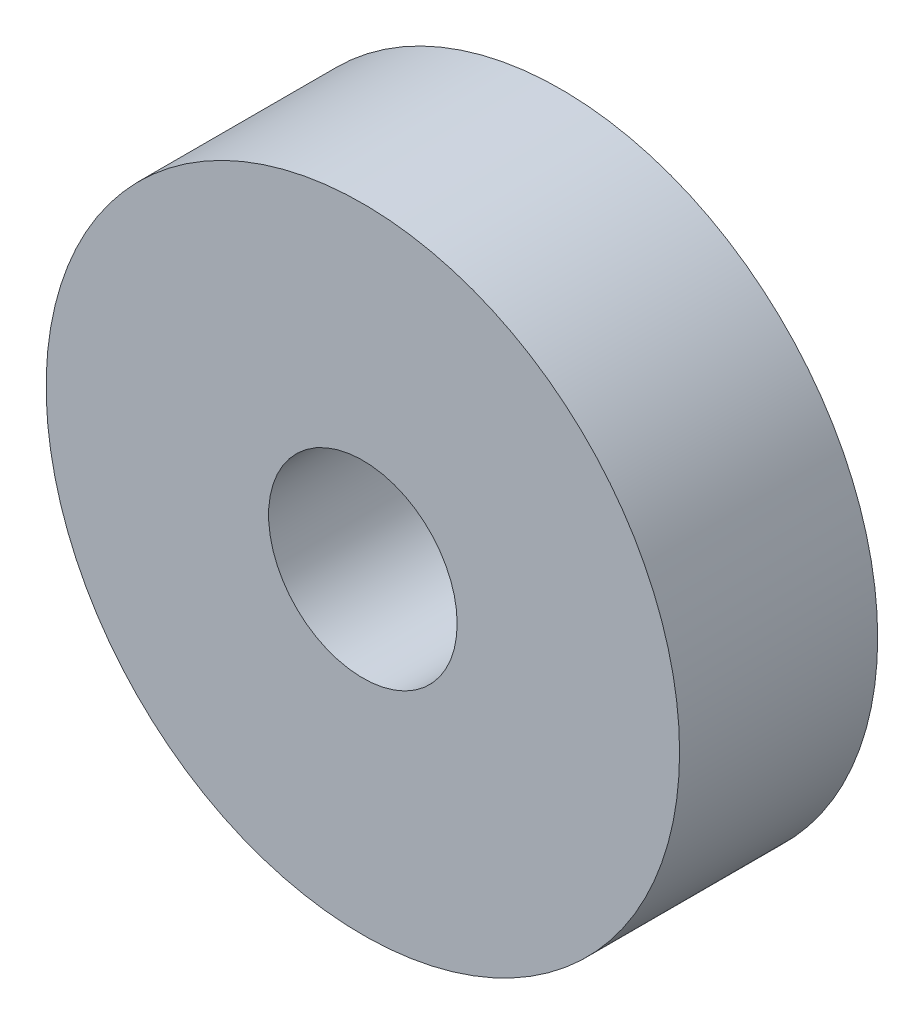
ISO-10303-21;
HEADER;
FILE_DESCRIPTION(('STEP AP214'),'2;1');
FILE_NAME('part.step','',(''),(''),'','','');
FILE_SCHEMA(('AUTOMOTIVE_DESIGN { 1 0 10303 214 1 1 1 1 }'));
ENDSEC;
DATA;
#1=APPLICATION_CONTEXT('core data for automotive mechanical design processes');
#2=APPLICATION_PROTOCOL_DEFINITION('international standard','automotive_design',2000,#1);
#3=PRODUCT_CONTEXT('',#1,'mechanical');
#4=PRODUCT('Part','Part','',(#3));
#5=PRODUCT_RELATED_PRODUCT_CATEGORY('part','',(#4));
#6=PRODUCT_DEFINITION_FORMATION('','',#4);
#7=PRODUCT_DEFINITION_CONTEXT('part definition',#1,'design');
#8=PRODUCT_DEFINITION('design','',#6,#7);
#9=PRODUCT_DEFINITION_SHAPE('','',#8);
#10=(LENGTH_UNIT() NAMED_UNIT(*) SI_UNIT(.MILLI.,.METRE.));
#11=(NAMED_UNIT(*) PLANE_ANGLE_UNIT() SI_UNIT($,.RADIAN.));
#12=(NAMED_UNIT(*) SI_UNIT($,.STERADIAN.) SOLID_ANGLE_UNIT());
#13=UNCERTAINTY_MEASURE_WITH_UNIT(LENGTH_MEASURE(1.E-05),#10,'distance_accuracy_value','');
#14=(GEOMETRIC_REPRESENTATION_CONTEXT(3) GLOBAL_UNCERTAINTY_ASSIGNED_CONTEXT((#13)) GLOBAL_UNIT_ASSIGNED_CONTEXT((#10,
#11,#12)) REPRESENTATION_CONTEXT('',''));
#15=CARTESIAN_POINT('',(0.,0.,0.));
#16=DIRECTION('',(0.,0.,1.));
#17=DIRECTION('',(1.,0.,0.));
#18=AXIS2_PLACEMENT_3D('',#15,#16,#17);
#19=CARTESIAN_POINT('',(0.,0.,3.175));
#20=DIRECTION('',(0.,0.,1.));
#21=DIRECTION('',(1.,0.,0.));
#22=AXIS2_PLACEMENT_3D('',#19,#20,#21);
#23=PLANE('',#22);
#24=CARTESIAN_POINT('',(0.,0.,3.175));
#25=DIRECTION('',(0.,0.,1.));
#26=DIRECTION('',(1.,0.,0.));
#27=AXIS2_PLACEMENT_3D('',#24,#25,#26);
#28=CIRCLE('',#27,5.0762);
#29=CARTESIAN_POINT('',(5.0762,0.,3.175));
#30=VERTEX_POINT('',#29);
#31=EDGE_CURVE('E12',#30,#30,#28,.T.);
#32=ORIENTED_EDGE('',*,*,#31,.T.);
#33=EDGE_LOOP('',(#32));
#34=FACE_BOUND('',#33,.T.);
#35=CARTESIAN_POINT('',(0.,0.,3.175));
#36=DIRECTION('',(0.,0.,1.));
#37=DIRECTION('',(1.,0.,0.));
#38=AXIS2_PLACEMENT_3D('',#35,#36,#37);
#39=CIRCLE('',#38,1.5113);
#40=CARTESIAN_POINT('',(1.5113,0.,3.175));
#41=VERTEX_POINT('',#40);
#42=EDGE_CURVE('E47',#41,#41,#39,.T.);
#43=ORIENTED_EDGE('',*,*,#42,.F.);
#44=EDGE_LOOP('',(#43));
#45=FACE_BOUND('',#44,.T.);
#46=ADVANCED_FACE('F36',(#34,#45),#23,.T.);
#47=CARTESIAN_POINT('',(0.,0.,0.));
#48=DIRECTION('',(0.,0.,1.));
#49=DIRECTION('',(1.,0.,0.));
#50=AXIS2_PLACEMENT_3D('',#47,#48,#49);
#51=PLANE('',#50);
#52=CARTESIAN_POINT('',(0.,0.,0.));
#53=DIRECTION('',(0.,0.,1.));
#54=DIRECTION('',(1.,0.,0.));
#55=AXIS2_PLACEMENT_3D('',#52,#53,#54);
#56=CIRCLE('',#55,5.0762);
#57=CARTESIAN_POINT('',(5.0762,0.,0.));
#58=VERTEX_POINT('',#57);
#59=EDGE_CURVE('E40',#58,#58,#56,.T.);
#60=ORIENTED_EDGE('',*,*,#59,.F.);
#61=EDGE_LOOP('',(#60));
#62=FACE_BOUND('',#61,.T.);
#63=CARTESIAN_POINT('',(0.,0.,0.));
#64=DIRECTION('',(0.,0.,1.));
#65=DIRECTION('',(1.,0.,0.));
#66=AXIS2_PLACEMENT_3D('',#63,#64,#65);
#67=CIRCLE('',#66,1.5113);
#68=CARTESIAN_POINT('',(1.5113,0.,0.));
#69=VERTEX_POINT('',#68);
#70=EDGE_CURVE('E50',#69,#69,#67,.T.);
#71=ORIENTED_EDGE('',*,*,#70,.T.);
#72=EDGE_LOOP('',(#71));
#73=FACE_BOUND('',#72,.T.);
#74=ADVANCED_FACE('F60',(#62,#73),#51,.F.);
#75=CARTESIAN_POINT('',(0.,0.,3.175));
#76=DIRECTION('',(0.,0.,-1.));
#77=DIRECTION('',(-1.,0.,0.));
#78=AXIS2_PLACEMENT_3D('',#75,#76,#77);
#79=CYLINDRICAL_SURFACE('',#78,5.0762);
#80=ORIENTED_EDGE('',*,*,#31,.F.);
#81=EDGE_LOOP('',(#80));
#82=FACE_BOUND('',#81,.T.);
#83=ORIENTED_EDGE('',*,*,#59,.T.);
#84=EDGE_LOOP('',(#83));
#85=FACE_BOUND('',#84,.T.);
#86=ADVANCED_FACE('F38',(#82,#85),#79,.T.);
#87=CARTESIAN_POINT('',(0.,0.,3.175));
#88=DIRECTION('',(0.,0.,-1.));
#89=DIRECTION('',(-1.,0.,0.));
#90=AXIS2_PLACEMENT_3D('',#87,#88,#89);
#91=CYLINDRICAL_SURFACE('',#90,1.5113);
#92=ORIENTED_EDGE('',*,*,#42,.T.);
#93=EDGE_LOOP('',(#92));
#94=FACE_BOUND('',#93,.T.);
#95=ORIENTED_EDGE('',*,*,#70,.F.);
#96=EDGE_LOOP('',(#95));
#97=FACE_BOUND('',#96,.T.);
#98=ADVANCED_FACE('F56',(#94,#97),#91,.F.);
#99=CLOSED_SHELL('',(#46,#74,#86,#98));
#100=MANIFOLD_SOLID_BREP('B2',#99);
#101=ADVANCED_BREP_SHAPE_REPRESENTATION('',(#18,#100),#14);
#102=SHAPE_DEFINITION_REPRESENTATION(#9,#101);
ENDSEC;
END-ISO-10303-21;
